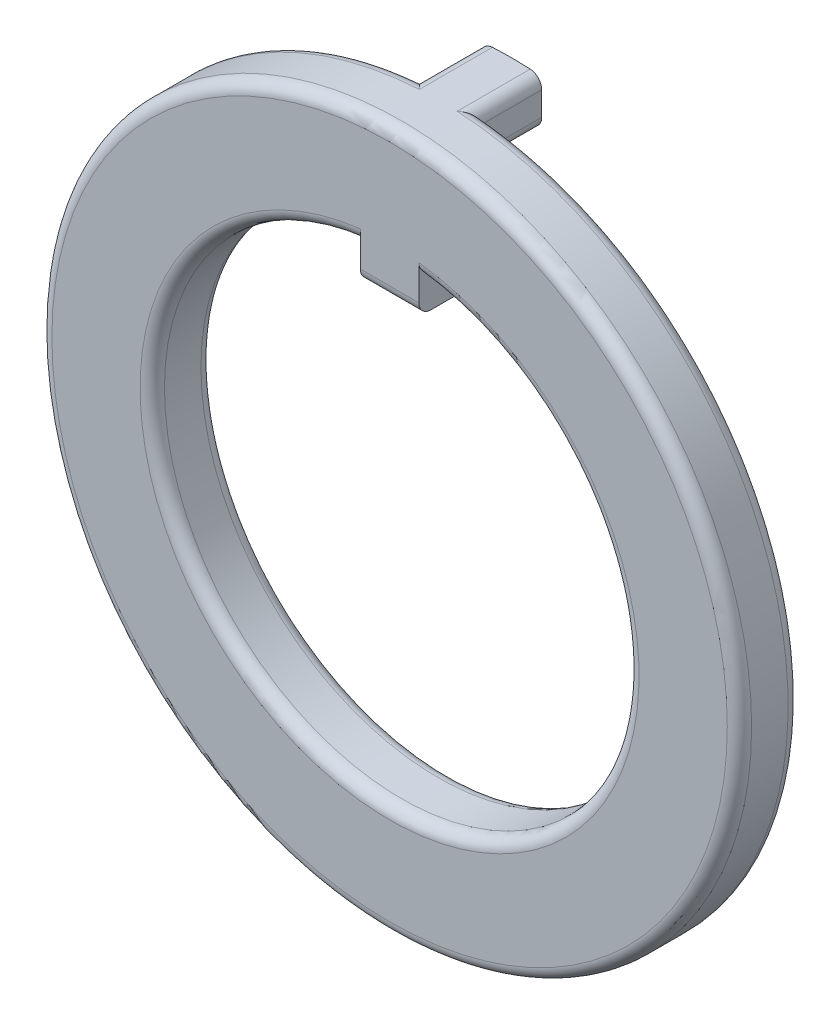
ISO-10303-21;
HEADER;
FILE_DESCRIPTION(('STEP AP214'),'2;1');
FILE_NAME('part.step','',(''),(''),'','','');
FILE_SCHEMA(('AUTOMOTIVE_DESIGN { 1 0 10303 214 1 1 1 1 }'));
ENDSEC;
DATA;
#1=APPLICATION_CONTEXT('core data for automotive mechanical design processes');
#2=APPLICATION_PROTOCOL_DEFINITION('international standard','automotive_design',2000,#1);
#3=PRODUCT_CONTEXT('',#1,'mechanical');
#4=PRODUCT('Part','Part','',(#3));
#5=PRODUCT_RELATED_PRODUCT_CATEGORY('part','',(#4));
#6=PRODUCT_DEFINITION_FORMATION('','',#4);
#7=PRODUCT_DEFINITION_CONTEXT('part definition',#1,'design');
#8=PRODUCT_DEFINITION('design','',#6,#7);
#9=PRODUCT_DEFINITION_SHAPE('','',#8);
#10=(LENGTH_UNIT() NAMED_UNIT(*) SI_UNIT(.MILLI.,.METRE.));
#11=(NAMED_UNIT(*) PLANE_ANGLE_UNIT() SI_UNIT($,.RADIAN.));
#12=(NAMED_UNIT(*) SI_UNIT($,.STERADIAN.) SOLID_ANGLE_UNIT());
#13=UNCERTAINTY_MEASURE_WITH_UNIT(LENGTH_MEASURE(1.E-05),#10,'distance_accuracy_value','');
#14=(GEOMETRIC_REPRESENTATION_CONTEXT(3) GLOBAL_UNCERTAINTY_ASSIGNED_CONTEXT((#13)) GLOBAL_UNIT_ASSIGNED_CONTEXT((#10,
#11,#12)) REPRESENTATION_CONTEXT('',''));
#15=CARTESIAN_POINT('',(0.,0.,0.));
#16=DIRECTION('',(0.,0.,1.));
#17=DIRECTION('',(1.,0.,0.));
#18=AXIS2_PLACEMENT_3D('',#15,#16,#17);
#19=CARTESIAN_POINT('',(0.,0.,2.));
#20=DIRECTION('',(0.,0.,1.));
#21=DIRECTION('',(1.,0.,0.));
#22=AXIS2_PLACEMENT_3D('',#19,#20,#21);
#23=PLANE('',#22);
#24=CARTESIAN_POINT('',(0.,0.,2.));
#25=DIRECTION('',(0.,0.,1.));
#26=DIRECTION('',(1.,0.,0.));
#27=AXIS2_PLACEMENT_3D('',#24,#25,#26);
#28=CIRCLE('',#27,5.55);
#29=CARTESIAN_POINT('',(5.55,0.,2.));
#30=VERTEX_POINT('',#29);
#31=EDGE_CURVE('E332',#30,#30,#28,.T.);
#32=ORIENTED_EDGE('',*,*,#31,.T.);
#33=EDGE_LOOP('',(#32));
#34=FACE_BOUND('',#33,.T.);
#35=DIRECTION('',(0.,1.,0.));
#36=VECTOR('',#35,1.);
#37=CARTESIAN_POINT('',(-0.479999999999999,3.87034882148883,2.));
#38=LINE('',#37,#36);
#39=CARTESIAN_POINT('',(-0.479999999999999,3.5,2.));
#40=VERTEX_POINT('',#39);
#41=CARTESIAN_POINT('',(-0.479999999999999,4.07180549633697,2.));
#42=VERTEX_POINT('',#41);
#43=EDGE_CURVE('E266',#40,#42,#38,.T.);
#44=ORIENTED_EDGE('',*,*,#43,.F.);
#45=DIRECTION('',(-1.,0.,0.));
#46=VECTOR('',#45,1.);
#47=CARTESIAN_POINT('',(0.,3.5,2.));
#48=LINE('',#47,#46);
#49=CARTESIAN_POINT('',(0.48,3.5,2.));
#50=VERTEX_POINT('',#49);
#51=EDGE_CURVE('E41',#40,#50,#48,.F.);
#52=ORIENTED_EDGE('',*,*,#51,.T.);
#53=DIRECTION('',(0.,-1.,0.));
#54=VECTOR('',#53,1.);
#55=CARTESIAN_POINT('',(0.48,3.3,2.));
#56=LINE('',#55,#54);
#57=CARTESIAN_POINT('',(0.48,4.07180549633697,2.));
#58=VERTEX_POINT('',#57);
#59=EDGE_CURVE('E384',#58,#50,#56,.T.);
#60=ORIENTED_EDGE('',*,*,#59,.F.);
#61=CARTESIAN_POINT('',(0.,0.,2.));
#62=DIRECTION('',(0.,0.,1.));
#63=DIRECTION('',(1.,0.,0.));
#64=AXIS2_PLACEMENT_3D('',#61,#62,#63);
#65=CIRCLE('',#64,4.1);
#66=EDGE_CURVE('E329',#58,#42,#65,.F.);
#67=ORIENTED_EDGE('',*,*,#66,.T.);
#68=EDGE_LOOP('',(#44,#52,#60,#67));
#69=FACE_BOUND('',#68,.T.);
#70=ADVANCED_FACE('F33',(#34,#69),#23,.T.);
#71=CARTESIAN_POINT('',(0.,0.,0.));
#72=DIRECTION('',(0.,0.,1.));
#73=DIRECTION('',(1.,0.,0.));
#74=AXIS2_PLACEMENT_3D('',#71,#72,#73);
#75=PLANE('',#74);
#76=CARTESIAN_POINT('',(0.,0.,0.));
#77=DIRECTION('',(0.,0.,1.));
#78=DIRECTION('',(1.,0.,0.));
#79=AXIS2_PLACEMENT_3D('',#76,#77,#78);
#80=CIRCLE('',#79,5.75);
#81=CARTESIAN_POINT('',(0.310810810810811,5.74159356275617,0.));
#82=VERTEX_POINT('',#81);
#83=CARTESIAN_POINT('',(-0.310810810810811,5.74159356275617,0.));
#84=VERTEX_POINT('',#83);
#85=EDGE_CURVE('E272',#82,#84,#80,.T.);
#86=ORIENTED_EDGE('',*,*,#85,.F.);
#87=CARTESIAN_POINT('',(0.3,5.54188596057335,0.));
#88=DIRECTION('',(0.,0.,1.));
#89=DIRECTION('',(1.,0.,0.));
#90=AXIS2_PLACEMENT_3D('',#87,#88,#89);
#91=CIRCLE('',#90,0.2);
#92=CARTESIAN_POINT('',(0.5,5.54188596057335,0.));
#93=VERTEX_POINT('',#92);
#94=EDGE_CURVE('E361',#82,#93,#91,.F.);
#95=ORIENTED_EDGE('',*,*,#94,.T.);
#96=DIRECTION('',(0.,1.,0.));
#97=VECTOR('',#96,1.);
#98=CARTESIAN_POINT('',(0.5,8.,0.));
#99=LINE('',#98,#97);
#100=CARTESIAN_POINT('',(0.5,5.15,0.));
#101=VERTEX_POINT('',#100);
#102=EDGE_CURVE('E173',#101,#93,#99,.T.);
#103=ORIENTED_EDGE('',*,*,#102,.F.);
#104=CARTESIAN_POINT('',(0.3,5.15,0.));
#105=DIRECTION('',(0.,0.,1.));
#106=DIRECTION('',(1.,0.,0.));
#107=AXIS2_PLACEMENT_3D('',#104,#105,#106);
#108=CIRCLE('',#107,0.2);
#109=CARTESIAN_POINT('',(0.3,4.95,0.));
#110=VERTEX_POINT('',#109);
#111=EDGE_CURVE('E363',#101,#110,#108,.F.);
#112=ORIENTED_EDGE('',*,*,#111,.T.);
#113=DIRECTION('',(-1.,0.,0.));
#114=VECTOR('',#113,1.);
#115=CARTESIAN_POINT('',(0.,4.95,0.));
#116=LINE('',#115,#114);
#117=CARTESIAN_POINT('',(-0.3,4.95,0.));
#118=VERTEX_POINT('',#117);
#119=EDGE_CURVE('E380',#110,#118,#116,.T.);
#120=ORIENTED_EDGE('',*,*,#119,.T.);
#121=CARTESIAN_POINT('',(-0.3,5.15,0.));
#122=DIRECTION('',(0.,0.,1.));
#123=DIRECTION('',(1.,0.,0.));
#124=AXIS2_PLACEMENT_3D('',#121,#122,#123);
#125=CIRCLE('',#124,0.2);
#126=CARTESIAN_POINT('',(-0.5,5.15,0.));
#127=VERTEX_POINT('',#126);
#128=EDGE_CURVE('E365',#118,#127,#125,.F.);
#129=ORIENTED_EDGE('',*,*,#128,.T.);
#130=DIRECTION('',(0.,-1.,0.));
#131=VECTOR('',#130,1.);
#132=CARTESIAN_POINT('',(-0.5,8.,0.));
#133=LINE('',#132,#131);
#134=CARTESIAN_POINT('',(-0.5,5.54188596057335,0.));
#135=VERTEX_POINT('',#134);
#136=EDGE_CURVE('E172',#135,#127,#133,.T.);
#137=ORIENTED_EDGE('',*,*,#136,.F.);
#138=CARTESIAN_POINT('',(-0.3,5.54188596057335,0.));
#139=DIRECTION('',(0.,0.,1.));
#140=DIRECTION('',(1.,0.,0.));
#141=AXIS2_PLACEMENT_3D('',#138,#139,#140);
#142=CIRCLE('',#141,0.2);
#143=EDGE_CURVE('E350',#135,#84,#142,.F.);
#144=ORIENTED_EDGE('',*,*,#143,.T.);
#145=EDGE_LOOP('',(#86,#95,#103,#112,#120,#129,#137,#144));
#146=FACE_BOUND('',#145,.T.);
#147=ADVANCED_FACE('F396',(#146),#75,.F.);
#148=CARTESIAN_POINT('',(0.,0.,2.));
#149=DIRECTION('',(0.,0.,-1.));
#150=DIRECTION('',(-1.,0.,0.));
#151=AXIS2_PLACEMENT_3D('',#148,#149,#150);
#152=CYLINDRICAL_SURFACE('',#151,5.75);
#153=CARTESIAN_POINT('',(0.,0.,1.8));
#154=DIRECTION('',(0.,0.,1.));
#155=DIRECTION('',(1.,0.,0.));
#156=AXIS2_PLACEMENT_3D('',#153,#154,#155);
#157=CIRCLE('',#156,5.75);
#158=CARTESIAN_POINT('',(5.75,0.,1.8));
#159=VERTEX_POINT('',#158);
#160=EDGE_CURVE('E326',#159,#159,#157,.F.);
#161=ORIENTED_EDGE('',*,*,#160,.T.);
#162=EDGE_LOOP('',(#161));
#163=FACE_BOUND('',#162,.T.);
#164=CARTESIAN_POINT('',(0.,0.,1.2));
#165=DIRECTION('',(0.,0.,1.));
#166=DIRECTION('',(0.,-1.,0.));
#167=AXIS2_PLACEMENT_3D('',#164,#165,#166);
#168=CIRCLE('',#167,5.75);
#169=CARTESIAN_POINT('',(-0.310810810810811,5.74159356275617,1.2));
#170=VERTEX_POINT('',#169);
#171=CARTESIAN_POINT('',(0.310810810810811,5.74159356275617,1.2));
#172=VERTEX_POINT('',#171);
#173=EDGE_CURVE('E178',#170,#172,#168,.T.);
#174=ORIENTED_EDGE('',*,*,#173,.T.);
#175=DIRECTION('',(0.,0.,-1.));
#176=VECTOR('',#175,1.);
#177=CARTESIAN_POINT('',(0.310810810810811,5.74159356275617,2.));
#178=LINE('',#177,#176);
#179=EDGE_CURVE('E368',#172,#82,#178,.T.);
#180=ORIENTED_EDGE('',*,*,#179,.T.);
#181=ORIENTED_EDGE('',*,*,#85,.T.);
#182=DIRECTION('',(0.,0.,-1.));
#183=VECTOR('',#182,1.);
#184=CARTESIAN_POINT('',(-0.310810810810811,5.74159356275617,2.));
#185=LINE('',#184,#183);
#186=EDGE_CURVE('E371',#84,#170,#185,.F.);
#187=ORIENTED_EDGE('',*,*,#186,.T.);
#188=EDGE_LOOP('',(#174,#180,#181,#187));
#189=FACE_BOUND('',#188,.T.);
#190=ADVANCED_FACE('F200',(#163,#189),#152,.T.);
#191=CARTESIAN_POINT('',(0.,0.,2.));
#192=DIRECTION('',(0.,0.,-1.));
#193=DIRECTION('',(-1.,0.,0.));
#194=AXIS2_PLACEMENT_3D('',#191,#192,#193);
#195=CYLINDRICAL_SURFACE('',#194,3.9);
#196=DIRECTION('',(0.,0.,-1.));
#197=VECTOR('',#196,1.);
#198=CARTESIAN_POINT('',(0.48,3.87034882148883,2.));
#199=LINE('',#198,#197);
#200=CARTESIAN_POINT('',(0.48,3.87034882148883,1.8));
#201=VERTEX_POINT('',#200);
#202=CARTESIAN_POINT('',(0.48,3.87034882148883,1.2));
#203=VERTEX_POINT('',#202);
#204=EDGE_CURVE('E263',#201,#203,#199,.T.);
#205=ORIENTED_EDGE('',*,*,#204,.T.);
#206=CARTESIAN_POINT('',(0.,0.,1.2));
#207=DIRECTION('',(0.,0.,1.));
#208=DIRECTION('',(0.,-1.,0.));
#209=AXIS2_PLACEMENT_3D('',#206,#207,#208);
#210=CIRCLE('',#209,3.9);
#211=CARTESIAN_POINT('',(-0.479999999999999,3.87034882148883,1.2));
#212=VERTEX_POINT('',#211);
#213=EDGE_CURVE('E291',#203,#212,#210,.F.);
#214=ORIENTED_EDGE('',*,*,#213,.T.);
#215=DIRECTION('',(0.,0.,-1.));
#216=VECTOR('',#215,1.);
#217=CARTESIAN_POINT('',(-0.479999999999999,3.87034882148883,2.));
#218=LINE('',#217,#216);
#219=CARTESIAN_POINT('',(-0.479999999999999,3.87034882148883,1.8));
#220=VERTEX_POINT('',#219);
#221=EDGE_CURVE('E261',#220,#212,#218,.T.);
#222=ORIENTED_EDGE('',*,*,#221,.F.);
#223=CARTESIAN_POINT('',(0.,0.,1.8));
#224=DIRECTION('',(0.,0.,1.));
#225=DIRECTION('',(1.,0.,0.));
#226=AXIS2_PLACEMENT_3D('',#223,#224,#225);
#227=CIRCLE('',#226,3.9);
#228=EDGE_CURVE('E334',#220,#201,#227,.T.);
#229=ORIENTED_EDGE('',*,*,#228,.T.);
#230=EDGE_LOOP('',(#205,#214,#222,#229));
#231=FACE_BOUND('',#230,.T.);
#232=ADVANCED_FACE('F317',(#231),#195,.F.);
#233=CARTESIAN_POINT('',(0.48,3.3,2.));
#234=DIRECTION('',(1.,0.,0.));
#235=DIRECTION('',(0.,0.,-1.));
#236=AXIS2_PLACEMENT_3D('',#233,#234,#235);
#237=PLANE('',#236);
#238=ORIENTED_EDGE('',*,*,#59,.T.);
#239=CARTESIAN_POINT('',(0.48,3.5,1.8));
#240=DIRECTION('',(1.,0.,0.));
#241=DIRECTION('',(0.,0.,-1.));
#242=AXIS2_PLACEMENT_3D('',#239,#240,#241);
#243=CIRCLE('',#242,0.2);
#244=CARTESIAN_POINT('',(0.48,3.3,1.8));
#245=VERTEX_POINT('',#244);
#246=EDGE_CURVE('E11',#50,#245,#243,.T.);
#247=ORIENTED_EDGE('',*,*,#246,.T.);
#248=DIRECTION('',(0.,0.,-1.));
#249=VECTOR('',#248,1.);
#250=CARTESIAN_POINT('',(0.48,3.3,2.));
#251=LINE('',#250,#249);
#252=CARTESIAN_POINT('',(0.48,3.3,1.2));
#253=VERTEX_POINT('',#252);
#254=EDGE_CURVE('E254',#245,#253,#251,.T.);
#255=ORIENTED_EDGE('',*,*,#254,.T.);
#256=CARTESIAN_POINT('',(0.480000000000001,3.5,1.2));
#257=DIRECTION('',(1.,0.,0.));
#258=DIRECTION('',(0.,0.,-1.));
#259=AXIS2_PLACEMENT_3D('',#256,#257,#258);
#260=CIRCLE('',#259,0.2);
#261=CARTESIAN_POINT('',(0.48,3.5,1.));
#262=VERTEX_POINT('',#261);
#263=EDGE_CURVE('E373',#253,#262,#260,.T.);
#264=ORIENTED_EDGE('',*,*,#263,.T.);
#265=DIRECTION('',(0.,-1.,0.));
#266=VECTOR('',#265,1.);
#267=CARTESIAN_POINT('',(0.48,3.3,1.));
#268=LINE('',#267,#266);
#269=CARTESIAN_POINT('',(0.48,4.07180549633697,1.));
#270=VERTEX_POINT('',#269);
#271=EDGE_CURVE('E379',#270,#262,#268,.T.);
#272=ORIENTED_EDGE('',*,*,#271,.F.);
#273=CARTESIAN_POINT('',(0.48,4.07180549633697,1.));
#274=CARTESIAN_POINT('',(0.48,4.06041357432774,0.999990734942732));
#275=CARTESIAN_POINT('',(0.48,4.04902416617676,1.00095943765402));
#276=CARTESIAN_POINT('',(0.48,4.02657338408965,1.00478417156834));
#277=CARTESIAN_POINT('',(0.48,4.01551181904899,1.00763907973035));
#278=CARTESIAN_POINT('',(0.48,3.99401968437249,1.01516977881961));
#279=CARTESIAN_POINT('',(0.48,3.98358945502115,1.01984654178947));
#280=CARTESIAN_POINT('',(0.48,3.96366727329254,1.03088806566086));
#281=CARTESIAN_POINT('',(0.48,3.95417510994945,1.03725244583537));
#282=CARTESIAN_POINT('',(0.48,3.93642754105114,1.051472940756));
#283=CARTESIAN_POINT('',(0.48,3.92816866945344,1.05932472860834));
#284=CARTESIAN_POINT('',(0.48,3.91309557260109,1.07631380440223));
#285=CARTESIAN_POINT('',(0.48,3.9062816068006,1.08545132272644));
#286=CARTESIAN_POINT('',(0.48,3.89434291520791,1.10468552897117));
#287=CARTESIAN_POINT('',(0.48,3.88920734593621,1.1147754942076));
#288=CARTESIAN_POINT('',(0.48,3.88071939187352,1.13567614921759));
#289=CARTESIAN_POINT('',(0.48,3.87736577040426,1.14648633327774));
#290=CARTESIAN_POINT('',(0.48,3.87342253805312,1.16447542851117));
#291=CARTESIAN_POINT('',(0.48,3.87227059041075,1.17153603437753));
#292=CARTESIAN_POINT('',(0.48,3.8707338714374,1.18573004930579));
#293=CARTESIAN_POINT('',(0.48,3.87034801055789,1.19286334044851));
#294=CARTESIAN_POINT('',(0.48,3.8703488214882,1.19999999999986));
#295=B_SPLINE_CURVE_WITH_KNOTS('',3,(#273,#274,#275,#276,#277,#278,#279,#280,#281,#282,#283,
#284,#285,#286,#287,#288,#289,#290,#291,#292,#293,#294),.UNSPECIFIED.,.F.,.F.,(4,2,2,2,2,2,2,2,
2,2,4),(0.,0.034131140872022,0.0682419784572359,0.102371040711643,0.136492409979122,
0.170516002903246,0.204545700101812,0.238350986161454,0.272132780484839,0.293556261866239,
0.314949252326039),.UNSPECIFIED.);
#296=EDGE_CURVE('E287',#270,#203,#295,.T.);
#297=ORIENTED_EDGE('',*,*,#296,.T.);
#298=ORIENTED_EDGE('',*,*,#204,.F.);
#299=CARTESIAN_POINT('',(0.48,3.87034882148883,1.8));
#300=CARTESIAN_POINT('',(0.48,3.87033889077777,1.81119067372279));
#301=CARTESIAN_POINT('',(0.48,3.8712946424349,1.82237795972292));
#302=CARTESIAN_POINT('',(0.48,3.8750635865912,1.84442405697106));
#303=CARTESIAN_POINT('',(0.48,3.87787490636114,1.85528318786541));
#304=CARTESIAN_POINT('',(0.48,3.88528282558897,1.87637932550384));
#305=CARTESIAN_POINT('',(0.48,3.88988014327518,1.88661608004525));
#306=CARTESIAN_POINT('',(0.48,3.90072110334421,1.90617498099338));
#307=CARTESIAN_POINT('',(0.48,3.906964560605,1.91549723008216));
#308=CARTESIAN_POINT('',(0.48,3.92094197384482,1.93300041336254));
#309=CARTESIAN_POINT('',(0.48,3.92868098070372,1.94117731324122));
#310=CARTESIAN_POINT('',(0.48,3.94541489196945,1.95612855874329));
#311=CARTESIAN_POINT('',(0.48,3.95441006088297,1.96290260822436));
#312=CARTESIAN_POINT('',(0.48,3.97346895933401,1.97490609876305));
#313=CARTESIAN_POINT('',(0.48,3.98354001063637,1.9801239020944));
#314=CARTESIAN_POINT('',(0.48,4.00440967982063,1.98880433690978));
#315=CARTESIAN_POINT('',(0.48,4.01520793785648,1.99226782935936));
#316=CARTESIAN_POINT('',(0.48,4.03368757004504,1.99653316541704));
#317=CARTESIAN_POINT('',(0.48,4.04125799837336,1.99783237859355));
#318=CARTESIAN_POINT('',(0.48,4.05648644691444,1.99956572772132));
#319=CARTESIAN_POINT('',(0.48,4.06414432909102,2.00000107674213));
#320=CARTESIAN_POINT('',(0.48,4.07180549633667,2.00000000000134));
#321=B_SPLINE_CURVE_WITH_KNOTS('',3,(#299,#300,#301,#302,#303,#304,#305,#306,#307,#308,#309,
#310,#311,#312,#313,#314,#315,#316,#317,#318,#319,#320),.UNSPECIFIED.,.F.,.F.,(4,2,2,2,2,2,2,2,
2,2,4),(0.,0.0335263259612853,0.0670188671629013,0.100524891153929,0.134027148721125,
0.167644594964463,0.201269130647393,0.235139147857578,0.268992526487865,0.291989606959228,
0.314954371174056),.UNSPECIFIED.);
#322=EDGE_CURVE('E295',#201,#58,#321,.T.);
#323=ORIENTED_EDGE('',*,*,#322,.T.);
#324=EDGE_LOOP('',(#238,#247,#255,#264,#272,#297,#298,#323));
#325=FACE_BOUND('',#324,.T.);
#326=ADVANCED_FACE('F312',(#325),#237,.T.);
#327=CARTESIAN_POINT('',(-0.479999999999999,3.3,2.));
#328=DIRECTION('',(0.,-1.,0.));
#329=DIRECTION('',(0.,0.,-1.));
#330=AXIS2_PLACEMENT_3D('',#327,#328,#329);
#331=PLANE('',#330);
#332=ORIENTED_EDGE('',*,*,#254,.F.);
#333=DIRECTION('',(-1.,0.,0.));
#334=VECTOR('',#333,1.);
#335=CARTESIAN_POINT('',(-0.479999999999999,3.3,1.8));
#336=LINE('',#335,#334);
#337=CARTESIAN_POINT('',(-0.479999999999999,3.3,1.8));
#338=VERTEX_POINT('',#337);
#339=EDGE_CURVE('E243',#245,#338,#336,.T.);
#340=ORIENTED_EDGE('',*,*,#339,.T.);
#341=DIRECTION('',(0.,0.,-1.));
#342=VECTOR('',#341,1.);
#343=CARTESIAN_POINT('',(-0.479999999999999,3.3,2.));
#344=LINE('',#343,#342);
#345=CARTESIAN_POINT('',(-0.479999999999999,3.3,1.2));
#346=VERTEX_POINT('',#345);
#347=EDGE_CURVE('E252',#338,#346,#344,.T.);
#348=ORIENTED_EDGE('',*,*,#347,.T.);
#349=DIRECTION('',(-1.,0.,0.));
#350=VECTOR('',#349,1.);
#351=CARTESIAN_POINT('',(0.48,3.3,1.2));
#352=LINE('',#351,#350);
#353=EDGE_CURVE('E375',#346,#253,#352,.F.);
#354=ORIENTED_EDGE('',*,*,#353,.T.);
#355=EDGE_LOOP('',(#332,#340,#348,#354));
#356=FACE_BOUND('',#355,.T.);
#357=ADVANCED_FACE('F250',(#356),#331,.T.);
#358=CARTESIAN_POINT('',(-0.479999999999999,3.87034882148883,2.));
#359=DIRECTION('',(-1.,0.,0.));
#360=DIRECTION('',(0.,-1.,0.));
#361=AXIS2_PLACEMENT_3D('',#358,#359,#360);
#362=PLANE('',#361);
#363=ORIENTED_EDGE('',*,*,#347,.F.);
#364=CARTESIAN_POINT('',(-0.479999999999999,3.5,1.8));
#365=DIRECTION('',(-1.,0.,0.));
#366=DIRECTION('',(0.,-1.,0.));
#367=AXIS2_PLACEMENT_3D('',#364,#365,#366);
#368=CIRCLE('',#367,0.2);
#369=EDGE_CURVE('E55',#338,#40,#368,.T.);
#370=ORIENTED_EDGE('',*,*,#369,.T.);
#371=ORIENTED_EDGE('',*,*,#43,.T.);
#372=CARTESIAN_POINT('',(-0.479999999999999,4.07180549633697,2.));
#373=CARTESIAN_POINT('',(-0.479999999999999,4.06041357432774,2.00000926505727));
#374=CARTESIAN_POINT('',(-0.479999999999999,4.04902416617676,1.99904056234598));
#375=CARTESIAN_POINT('',(-0.479999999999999,4.02657338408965,1.99521582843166));
#376=CARTESIAN_POINT('',(-0.479999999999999,4.01551181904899,1.99236092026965));
#377=CARTESIAN_POINT('',(-0.479999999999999,3.99401968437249,1.98483022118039));
#378=CARTESIAN_POINT('',(-0.479999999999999,3.98358945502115,1.98015345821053));
#379=CARTESIAN_POINT('',(-0.479999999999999,3.96366727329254,1.96911193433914));
#380=CARTESIAN_POINT('',(-0.479999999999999,3.95417510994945,1.96274755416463));
#381=CARTESIAN_POINT('',(-0.479999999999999,3.93642754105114,1.948527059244));
#382=CARTESIAN_POINT('',(-0.479999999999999,3.92816866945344,1.94067527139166));
#383=CARTESIAN_POINT('',(-0.479999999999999,3.91309557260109,1.92368619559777));
#384=CARTESIAN_POINT('',(-0.479999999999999,3.9062816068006,1.91454867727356));
#385=CARTESIAN_POINT('',(-0.479999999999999,3.89434291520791,1.89531447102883));
#386=CARTESIAN_POINT('',(-0.479999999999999,3.88920734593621,1.8852245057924));
#387=CARTESIAN_POINT('',(-0.479999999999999,3.88071939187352,1.86432385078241));
#388=CARTESIAN_POINT('',(-0.479999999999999,3.87736577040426,1.85351366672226));
#389=CARTESIAN_POINT('',(-0.479999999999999,3.87342253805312,1.83552457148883));
#390=CARTESIAN_POINT('',(-0.479999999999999,3.87227059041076,1.82846396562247));
#391=CARTESIAN_POINT('',(-0.479999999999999,3.8707338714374,1.81426995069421));
#392=CARTESIAN_POINT('',(-0.479999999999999,3.87034801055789,1.80713665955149));
#393=CARTESIAN_POINT('',(-0.479999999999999,3.8703488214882,1.80000000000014));
#394=B_SPLINE_CURVE_WITH_KNOTS('',3,(#372,#373,#374,#375,#376,#377,#378,#379,#380,#381,#382,
#383,#384,#385,#386,#387,#388,#389,#390,#391,#392,#393),.UNSPECIFIED.,.F.,.F.,(4,2,2,2,2,2,2,2,
2,2,4),(0.,0.034131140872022,0.0682419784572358,0.102371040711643,0.136492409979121,
0.170516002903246,0.204545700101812,0.238350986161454,0.272132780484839,0.293556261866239,
0.314949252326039),.UNSPECIFIED.);
#395=EDGE_CURVE('E292',#42,#220,#394,.T.);
#396=ORIENTED_EDGE('',*,*,#395,.T.);
#397=ORIENTED_EDGE('',*,*,#221,.T.);
#398=CARTESIAN_POINT('',(-0.479999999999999,3.87034882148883,1.2));
#399=CARTESIAN_POINT('',(-0.479999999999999,3.87033889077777,1.18880932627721));
#400=CARTESIAN_POINT('',(-0.479999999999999,3.8712946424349,1.17762204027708));
#401=CARTESIAN_POINT('',(-0.479999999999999,3.8750635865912,1.15557594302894));
#402=CARTESIAN_POINT('',(-0.479999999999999,3.87787490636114,1.14471681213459));
#403=CARTESIAN_POINT('',(-0.479999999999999,3.88528282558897,1.12362067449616));
#404=CARTESIAN_POINT('',(-0.479999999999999,3.88988014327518,1.11338391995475));
#405=CARTESIAN_POINT('',(-0.479999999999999,3.90072110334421,1.09382501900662));
#406=CARTESIAN_POINT('',(-0.479999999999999,3.906964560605,1.08450276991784));
#407=CARTESIAN_POINT('',(-0.479999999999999,3.92094197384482,1.06699958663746));
#408=CARTESIAN_POINT('',(-0.479999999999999,3.92868098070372,1.05882268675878));
#409=CARTESIAN_POINT('',(-0.479999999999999,3.94541489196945,1.04387144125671));
#410=CARTESIAN_POINT('',(-0.479999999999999,3.95441006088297,1.03709739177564));
#411=CARTESIAN_POINT('',(-0.479999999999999,3.97346895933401,1.02509390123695));
#412=CARTESIAN_POINT('',(-0.479999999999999,3.98354001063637,1.0198760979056));
#413=CARTESIAN_POINT('',(-0.479999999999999,4.00440967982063,1.01119566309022));
#414=CARTESIAN_POINT('',(-0.479999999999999,4.01520793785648,1.00773217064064));
#415=CARTESIAN_POINT('',(-0.479999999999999,4.03368757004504,1.00346683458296));
#416=CARTESIAN_POINT('',(-0.479999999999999,4.04125799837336,1.00216762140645));
#417=CARTESIAN_POINT('',(-0.479999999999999,4.05648644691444,1.00043427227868));
#418=CARTESIAN_POINT('',(-0.479999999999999,4.06414432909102,0.999998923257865));
#419=CARTESIAN_POINT('',(-0.479999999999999,4.07180549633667,0.99999999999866));
#420=B_SPLINE_CURVE_WITH_KNOTS('',3,(#398,#399,#400,#401,#402,#403,#404,#405,#406,#407,#408,
#409,#410,#411,#412,#413,#414,#415,#416,#417,#418,#419),.UNSPECIFIED.,.F.,.F.,(4,2,2,2,2,2,2,2,
2,2,4),(0.,0.0335263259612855,0.0670188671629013,0.100524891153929,0.134027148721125,
0.167644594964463,0.201269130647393,0.235139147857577,0.268992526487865,0.291989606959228,
0.314954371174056),.UNSPECIFIED.);
#421=CARTESIAN_POINT('',(-0.479999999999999,4.07180549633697,1.));
#422=VERTEX_POINT('',#421);
#423=EDGE_CURVE('E283',#212,#422,#420,.T.);
#424=ORIENTED_EDGE('',*,*,#423,.T.);
#425=DIRECTION('',(0.,1.,0.));
#426=VECTOR('',#425,1.);
#427=CARTESIAN_POINT('',(-0.479999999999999,3.87034882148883,1.));
#428=LINE('',#427,#426);
#429=CARTESIAN_POINT('',(-0.479999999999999,3.5,1.));
#430=VERTEX_POINT('',#429);
#431=EDGE_CURVE('E180',#430,#422,#428,.T.);
#432=ORIENTED_EDGE('',*,*,#431,.F.);
#433=CARTESIAN_POINT('',(-0.48,3.5,1.2));
#434=DIRECTION('',(-1.,0.,0.));
#435=DIRECTION('',(0.,-1.,0.));
#436=AXIS2_PLACEMENT_3D('',#433,#434,#435);
#437=CIRCLE('',#436,0.2);
#438=EDGE_CURVE('E259',#430,#346,#437,.T.);
#439=ORIENTED_EDGE('',*,*,#438,.T.);
#440=EDGE_LOOP('',(#363,#370,#371,#396,#397,#424,#432,#439));
#441=FACE_BOUND('',#440,.T.);
#442=ADVANCED_FACE('F257',(#441),#362,.T.);
#443=CARTESIAN_POINT('',(-10.,4.95,1.));
#444=DIRECTION('',(0.,1.,0.));
#445=DIRECTION('',(0.,0.,1.));
#446=AXIS2_PLACEMENT_3D('',#443,#444,#445);
#447=PLANE('',#446);
#448=ORIENTED_EDGE('',*,*,#119,.F.);
#449=DIRECTION('',(0.,0.,1.));
#450=VECTOR('',#449,1.);
#451=CARTESIAN_POINT('',(0.3,4.95,1.));
#452=LINE('',#451,#450);
#453=CARTESIAN_POINT('',(0.3,4.95,1.));
#454=VERTEX_POINT('',#453);
#455=EDGE_CURVE('E351',#110,#454,#452,.T.);
#456=ORIENTED_EDGE('',*,*,#455,.T.);
#457=DIRECTION('',(1.,0.,0.));
#458=VECTOR('',#457,1.);
#459=CARTESIAN_POINT('',(-10.,4.95,1.));
#460=LINE('',#459,#458);
#461=CARTESIAN_POINT('',(-0.3,4.95,1.));
#462=VERTEX_POINT('',#461);
#463=EDGE_CURVE('E381',#462,#454,#460,.T.);
#464=ORIENTED_EDGE('',*,*,#463,.F.);
#465=DIRECTION('',(0.,0.,-1.));
#466=VECTOR('',#465,1.);
#467=CARTESIAN_POINT('',(-0.3,4.95,1.));
#468=LINE('',#467,#466);
#469=EDGE_CURVE('E353',#462,#118,#468,.T.);
#470=ORIENTED_EDGE('',*,*,#469,.T.);
#471=EDGE_LOOP('',(#448,#456,#464,#470));
#472=FACE_BOUND('',#471,.T.);
#473=ADVANCED_FACE('F427',(#472),#447,.F.);
#474=CARTESIAN_POINT('',(-10.,4.95,1.));
#475=DIRECTION('',(0.,0.,1.));
#476=DIRECTION('',(0.,-1.,0.));
#477=AXIS2_PLACEMENT_3D('',#474,#475,#476);
#478=PLANE('',#477);
#479=ORIENTED_EDGE('',*,*,#463,.T.);
#480=CARTESIAN_POINT('',(0.3,5.15,1.));
#481=DIRECTION('',(0.,0.,1.));
#482=DIRECTION('',(0.,-1.,0.));
#483=AXIS2_PLACEMENT_3D('',#480,#481,#482);
#484=CIRCLE('',#483,0.2);
#485=CARTESIAN_POINT('',(0.5,5.15,1.));
#486=VERTEX_POINT('',#485);
#487=EDGE_CURVE('E171',#454,#486,#484,.T.);
#488=ORIENTED_EDGE('',*,*,#487,.T.);
#489=DIRECTION('',(0.,1.,0.));
#490=VECTOR('',#489,1.);
#491=CARTESIAN_POINT('',(0.5,8.,1.));
#492=LINE('',#491,#490);
#493=CARTESIAN_POINT('',(0.5,5.52743159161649,1.));
#494=VERTEX_POINT('',#493);
#495=EDGE_CURVE('E154',#486,#494,#492,.T.);
#496=ORIENTED_EDGE('',*,*,#495,.T.);
#497=CARTESIAN_POINT('',(0.,0.,0.999999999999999));
#498=DIRECTION('',(0.,0.,1.));
#499=DIRECTION('',(0.,-1.,0.));
#500=AXIS2_PLACEMENT_3D('',#497,#498,#499);
#501=CIRCLE('',#500,5.55);
#502=CARTESIAN_POINT('',(-0.5,5.52743159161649,1.));
#503=VERTEX_POINT('',#502);
#504=EDGE_CURVE('E163',#494,#503,#501,.F.);
#505=ORIENTED_EDGE('',*,*,#504,.T.);
#506=DIRECTION('',(0.,-1.,0.));
#507=VECTOR('',#506,1.);
#508=CARTESIAN_POINT('',(-0.5,8.,1.));
#509=LINE('',#508,#507);
#510=CARTESIAN_POINT('',(-0.5,5.15,1.));
#511=VERTEX_POINT('',#510);
#512=EDGE_CURVE('E345',#503,#511,#509,.T.);
#513=ORIENTED_EDGE('',*,*,#512,.T.);
#514=CARTESIAN_POINT('',(-0.3,5.15,1.));
#515=DIRECTION('',(0.,0.,1.));
#516=DIRECTION('',(0.,-1.,0.));
#517=AXIS2_PLACEMENT_3D('',#514,#515,#516);
#518=CIRCLE('',#517,0.2);
#519=EDGE_CURVE('E244',#511,#462,#518,.T.);
#520=ORIENTED_EDGE('',*,*,#519,.T.);
#521=EDGE_LOOP('',(#479,#488,#496,#505,#513,#520));
#522=FACE_BOUND('',#521,.T.);
#523=ORIENTED_EDGE('',*,*,#271,.T.);
#524=DIRECTION('',(-1.,0.,0.));
#525=VECTOR('',#524,1.);
#526=CARTESIAN_POINT('',(-0.48,3.5,1.));
#527=LINE('',#526,#525);
#528=EDGE_CURVE('E281',#262,#430,#527,.T.);
#529=ORIENTED_EDGE('',*,*,#528,.T.);
#530=ORIENTED_EDGE('',*,*,#431,.T.);
#531=CARTESIAN_POINT('',(0.,0.,0.999999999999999));
#532=DIRECTION('',(0.,0.,1.));
#533=DIRECTION('',(0.,-1.,0.));
#534=AXIS2_PLACEMENT_3D('',#531,#532,#533);
#535=CIRCLE('',#534,4.1);
#536=EDGE_CURVE('E279',#422,#270,#535,.T.);
#537=ORIENTED_EDGE('',*,*,#536,.T.);
#538=EDGE_LOOP('',(#523,#529,#530,#537));
#539=FACE_BOUND('',#538,.T.);
#540=ADVANCED_FACE('F167',(#522,#539),#478,.F.);
#541=CARTESIAN_POINT('',(-0.5,8.,1.));
#542=DIRECTION('',(1.,0.,0.));
#543=DIRECTION('',(0.,1.,0.));
#544=AXIS2_PLACEMENT_3D('',#541,#542,#543);
#545=PLANE('',#544);
#546=ORIENTED_EDGE('',*,*,#136,.T.);
#547=DIRECTION('',(0.,0.,-1.));
#548=VECTOR('',#547,1.);
#549=CARTESIAN_POINT('',(-0.5,5.15,1.));
#550=LINE('',#549,#548);
#551=EDGE_CURVE('E216',#127,#511,#550,.F.);
#552=ORIENTED_EDGE('',*,*,#551,.T.);
#553=ORIENTED_EDGE('',*,*,#512,.F.);
#554=CARTESIAN_POINT('',(-0.5,5.52743159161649,1.));
#555=CARTESIAN_POINT('',(-0.5,5.53876060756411,0.999990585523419));
#556=CARTESIAN_POINT('',(-0.5,5.55008707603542,1.00095423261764));
#557=CARTESIAN_POINT('',(-0.5,5.57241285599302,1.00475884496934));
#558=CARTESIAN_POINT('',(-0.5,5.58341237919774,1.00759856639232));
#559=CARTESIAN_POINT('',(-0.5,5.60478366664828,1.01508865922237));
#560=CARTESIAN_POINT('',(-0.5,5.61515509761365,1.01973998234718));
#561=CARTESIAN_POINT('',(-0.5,5.63496584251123,1.03071958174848));
#562=CARTESIAN_POINT('',(-0.5,5.64440535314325,1.03704750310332));
#563=CARTESIAN_POINT('',(-0.5,5.66206594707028,1.05119005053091));
#564=CARTESIAN_POINT('',(-0.5,5.67028935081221,1.05900177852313));
#565=CARTESIAN_POINT('',(-0.5,5.68530367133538,1.07590145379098));
#566=CARTESIAN_POINT('',(-0.5,5.69209431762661,1.08498964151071));
#567=CARTESIAN_POINT('',(-0.5,5.70402212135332,1.10414713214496));
#568=CARTESIAN_POINT('',(-0.5,5.70916505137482,1.11421284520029));
#569=CARTESIAN_POINT('',(-0.5,5.71767864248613,1.13506468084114));
#570=CARTESIAN_POINT('',(-0.5,5.72105043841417,1.14585033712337));
#571=CARTESIAN_POINT('',(-0.5,5.7250607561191,1.16392179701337));
#572=CARTESIAN_POINT('',(-0.5,5.72624462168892,1.17109125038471));
#573=CARTESIAN_POINT('',(-0.5,5.72782392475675,1.18550610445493));
#574=CARTESIAN_POINT('',(-0.5,5.72822048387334,1.19275138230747));
#575=CARTESIAN_POINT('',(-0.5,5.72821961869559,1.19999999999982));
#576=B_SPLINE_CURVE_WITH_KNOTS('',3,(#554,#555,#556,#557,#558,#559,#560,#561,#562,#563,#564,
#565,#566,#567,#568,#569,#570,#571,#572,#573,#574,#575),.UNSPECIFIED.,.F.,.F.,(4,2,2,2,2,2,2,2,
2,2,4),(0.,0.033942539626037,0.0678625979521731,0.101800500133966,0.135731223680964,
0.169596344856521,0.203467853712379,0.237219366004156,0.270949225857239,0.292708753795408,
0.314437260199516),.UNSPECIFIED.);
#577=CARTESIAN_POINT('',(-0.5,5.54188596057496,1.00051876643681));
#578=VERTEX_POINT('',#577);
#579=EDGE_CURVE('E162',#503,#578,#576,.T.);
#580=ORIENTED_EDGE('',*,*,#579,.T.);
#581=DIRECTION('',(0.,0.,-1.));
#582=VECTOR('',#581,1.);
#583=CARTESIAN_POINT('',(-0.5,5.54188596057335,1.));
#584=LINE('',#583,#582);
#585=EDGE_CURVE('E343',#578,#135,#584,.T.);
#586=ORIENTED_EDGE('',*,*,#585,.T.);
#587=EDGE_LOOP('',(#546,#552,#553,#580,#586));
#588=FACE_BOUND('',#587,.T.);
#589=ADVANCED_FACE('F342',(#588),#545,.F.);
#590=CARTESIAN_POINT('',(0.5,8.,1.));
#591=DIRECTION('',(-1.,0.,0.));
#592=DIRECTION('',(0.,-1.,0.));
#593=AXIS2_PLACEMENT_3D('',#590,#591,#592);
#594=PLANE('',#593);
#595=ORIENTED_EDGE('',*,*,#102,.T.);
#596=DIRECTION('',(0.,0.,-1.));
#597=VECTOR('',#596,1.);
#598=CARTESIAN_POINT('',(0.5,5.54188596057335,1.));
#599=LINE('',#598,#597);
#600=CARTESIAN_POINT('',(0.5,5.54188596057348,1.0005187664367));
#601=VERTEX_POINT('',#600);
#602=EDGE_CURVE('E157',#93,#601,#599,.F.);
#603=ORIENTED_EDGE('',*,*,#602,.T.);
#604=CARTESIAN_POINT('',(0.5,5.7282196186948,1.2));
#605=CARTESIAN_POINT('',(0.5,5.72822934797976,1.18877953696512));
#606=CARTESIAN_POINT('',(0.5,5.72727237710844,1.17756217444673));
#607=CARTESIAN_POINT('',(0.5,5.72349712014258,1.1554549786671));
#608=CARTESIAN_POINT('',(0.5,5.72068049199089,1.14456486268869));
#609=CARTESIAN_POINT('',(0.5,5.71325612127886,1.12340769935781));
#610=CARTESIAN_POINT('',(0.5,5.70864758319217,1.11314093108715));
#611=CARTESIAN_POINT('',(0.5,5.69777636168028,1.09352650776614));
#612=CARTESIAN_POINT('',(0.5,5.69151392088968,1.0841787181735));
#613=CARTESIAN_POINT('',(0.5,5.67750201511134,1.06664846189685));
#614=CARTESIAN_POINT('',(0.5,5.66975014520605,1.0584679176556));
#615=CARTESIAN_POINT('',(0.5,5.65298574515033,1.0435171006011));
#616=CARTESIAN_POINT('',(0.5,5.64397296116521,1.03674711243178));
#617=CARTESIAN_POINT('',(0.5,5.62490855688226,1.02478441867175));
#618=CARTESIAN_POINT('',(0.5,5.61485312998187,1.01959778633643));
#619=CARTESIAN_POINT('',(0.5,5.59401818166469,1.01098188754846));
#620=CARTESIAN_POINT('',(0.5,5.58323904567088,1.00755169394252));
#621=CARTESIAN_POINT('',(0.5,5.56490397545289,1.00336917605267));
#622=CARTESIAN_POINT('',(0.5,5.5574603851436,1.0021064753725));
#623=CARTESIAN_POINT('',(0.5,5.54248939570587,1.00042197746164));
#624=CARTESIAN_POINT('',(0.5,5.53496213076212,0.999998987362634));
#625=CARTESIAN_POINT('',(0.5,5.52743159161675,0.999999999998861));
#626=B_SPLINE_CURVE_WITH_KNOTS('',3,(#604,#605,#606,#607,#608,#609,#610,#611,#612,#613,#614,
#615,#616,#617,#618,#619,#620,#621,#622,#623,#624,#625),.UNSPECIFIED.,.F.,.F.,(4,2,2,2,2,2,2,2,
2,2,4),(0.,0.0336161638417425,0.0672023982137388,0.100803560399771,0.134399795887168,
0.168050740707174,0.201708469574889,0.235493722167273,0.269261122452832,0.291866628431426,
0.314439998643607),.UNSPECIFIED.);
#627=EDGE_CURVE('E150',#601,#494,#626,.T.);
#628=ORIENTED_EDGE('',*,*,#627,.T.);
#629=ORIENTED_EDGE('',*,*,#495,.F.);
#630=DIRECTION('',(0.,0.,1.));
#631=VECTOR('',#630,1.);
#632=CARTESIAN_POINT('',(0.5,5.15,1.));
#633=LINE('',#632,#631);
#634=EDGE_CURVE('E359',#486,#101,#633,.F.);
#635=ORIENTED_EDGE('',*,*,#634,.T.);
#636=EDGE_LOOP('',(#595,#603,#628,#629,#635));
#637=FACE_BOUND('',#636,.T.);
#638=ADVANCED_FACE('F153',(#637),#594,.F.);
#639=CARTESIAN_POINT('',(0.,0.,1.2));
#640=DIRECTION('',(0.,0.,1.));
#641=DIRECTION('',(0.,-1.,0.));
#642=AXIS2_PLACEMENT_3D('',#639,#640,#641);
#643=TOROIDAL_SURFACE('',#642,5.55,0.2);
#644=ORIENTED_EDGE('',*,*,#579,.F.);
#645=ORIENTED_EDGE('',*,*,#504,.F.);
#646=ORIENTED_EDGE('',*,*,#627,.F.);
#647=CARTESIAN_POINT('',(0.5,5.54188596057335,1.0005187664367));
#648=CARTESIAN_POINT('',(0.500013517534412,5.5513106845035,1.00118327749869));
#649=CARTESIAN_POINT('',(0.499335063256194,5.56065128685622,1.00252799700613));
#650=CARTESIAN_POINT('',(0.496766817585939,5.57882824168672,1.00637572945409));
#651=CARTESIAN_POINT('',(0.494888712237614,5.58766857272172,1.00886750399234));
#652=CARTESIAN_POINT('',(0.490097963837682,5.60466326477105,1.01481447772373));
#653=CARTESIAN_POINT('',(0.487189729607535,5.61282036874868,1.0182655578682));
#654=CARTESIAN_POINT('',(0.480518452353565,5.62840215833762,1.02594701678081));
#655=CARTESIAN_POINT('',(0.476753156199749,5.63582483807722,1.03017944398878));
#656=CARTESIAN_POINT('',(0.466581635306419,5.6532182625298,1.04140958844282));
#657=CARTESIAN_POINT('',(0.459771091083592,5.66272182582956,1.04876510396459));
#658=CARTESIAN_POINT('',(0.445087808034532,5.68001158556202,1.06437575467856));
#659=CARTESIAN_POINT('',(0.437212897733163,5.68779418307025,1.07263272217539));
#660=CARTESIAN_POINT('',(0.417754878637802,5.70420873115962,1.09281972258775));
#661=CARTESIAN_POINT('',(0.405853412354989,5.71214755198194,1.10500658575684));
#662=CARTESIAN_POINT('',(0.381219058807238,5.72518326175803,1.12998770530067));
#663=CARTESIAN_POINT('',(0.368486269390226,5.73028048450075,1.14278189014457));
#664=CARTESIAN_POINT('',(0.341505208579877,5.73807296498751,1.16970037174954));
#665=CARTESIAN_POINT('',(0.327216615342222,5.74054707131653,1.18384998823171));
#666=CARTESIAN_POINT('',(0.312177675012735,5.74151604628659,1.19865496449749));
#667=CARTESIAN_POINT('',(0.311494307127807,5.74155655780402,1.19932751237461));
#668=CARTESIAN_POINT('',(0.310810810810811,5.74159356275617,1.2));
#669=B_SPLINE_CURVE_WITH_KNOTS('',3,(#647,#648,#649,#650,#651,#652,#653,#654,#655,#656,#657,
#658,#659,#660,#661,#662,#663,#664,#665,#666,#667,#668),.UNSPECIFIED.,.F.,.F.,(4,2,2,2,2,2,2,2,
2,2,4),(0.,0.0282425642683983,0.0562141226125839,0.0840673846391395,0.111994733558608,
0.153204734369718,0.194500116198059,0.250577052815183,0.30664740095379,0.367140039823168,
0.370018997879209),.UNSPECIFIED.);
#670=EDGE_CURVE('E209',#601,#172,#669,.T.);
#671=ORIENTED_EDGE('',*,*,#670,.T.);
#672=ORIENTED_EDGE('',*,*,#173,.F.);
#673=CARTESIAN_POINT('',(-0.5,5.54188596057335,1.00051876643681));
#674=CARTESIAN_POINT('',(-0.500013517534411,5.55131068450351,1.00118327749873));
#675=CARTESIAN_POINT('',(-0.499335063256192,5.56065128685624,1.00252799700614));
#676=CARTESIAN_POINT('',(-0.496766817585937,5.57882824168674,1.00637572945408));
#677=CARTESIAN_POINT('',(-0.494888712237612,5.58766857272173,1.00886750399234));
#678=CARTESIAN_POINT('',(-0.490097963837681,5.60466326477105,1.01481447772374));
#679=CARTESIAN_POINT('',(-0.487189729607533,5.61282036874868,1.0182655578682));
#680=CARTESIAN_POINT('',(-0.480518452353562,5.62840215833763,1.02594701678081));
#681=CARTESIAN_POINT('',(-0.476753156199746,5.63582483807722,1.03017944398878));
#682=CARTESIAN_POINT('',(-0.466581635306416,5.65321826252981,1.04140958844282));
#683=CARTESIAN_POINT('',(-0.45977109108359,5.66272182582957,1.0487651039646));
#684=CARTESIAN_POINT('',(-0.445087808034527,5.68001158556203,1.06437575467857));
#685=CARTESIAN_POINT('',(-0.437212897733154,5.68779418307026,1.07263272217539));
#686=CARTESIAN_POINT('',(-0.417754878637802,5.70420873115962,1.09281972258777));
#687=CARTESIAN_POINT('',(-0.405853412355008,5.71214755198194,1.10500658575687));
#688=CARTESIAN_POINT('',(-0.381219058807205,5.72518326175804,1.12998770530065));
#689=CARTESIAN_POINT('',(-0.368486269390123,5.73028048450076,1.14278189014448));
#690=CARTESIAN_POINT('',(-0.341505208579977,5.7380729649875,1.16970037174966));
#691=CARTESIAN_POINT('',(-0.327216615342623,5.7405470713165,1.18384998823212));
#692=CARTESIAN_POINT('',(-0.312177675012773,5.74151604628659,1.19865496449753));
#693=CARTESIAN_POINT('',(-0.311494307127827,5.74155655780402,1.19932751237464));
#694=CARTESIAN_POINT('',(-0.310810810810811,5.74159356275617,1.2));
#695=B_SPLINE_CURVE_WITH_KNOTS('',3,(#673,#674,#675,#676,#677,#678,#679,#680,#681,#682,#683,
#684,#685,#686,#687,#688,#689,#690,#691,#692,#693,#694),.UNSPECIFIED.,.F.,.F.,(4,2,2,2,2,2,2,2,
2,2,4),(0.,0.0282425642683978,0.0562141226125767,0.084067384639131,0.1119947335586,
0.153204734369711,0.194500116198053,0.250577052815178,0.306647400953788,0.367140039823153,
0.370018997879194),.UNSPECIFIED.);
#696=EDGE_CURVE('E238',#170,#578,#695,.F.);
#697=ORIENTED_EDGE('',*,*,#696,.T.);
#698=EDGE_LOOP('',(#644,#645,#646,#671,#672,#697));
#699=FACE_BOUND('',#698,.T.);
#700=ADVANCED_FACE('F176',(#699),#643,.T.);
#701=CARTESIAN_POINT('',(0.,0.,1.8));
#702=DIRECTION('',(0.,0.,1.));
#703=DIRECTION('',(1.,0.,0.));
#704=AXIS2_PLACEMENT_3D('',#701,#702,#703);
#705=TOROIDAL_SURFACE('',#704,4.1,0.2);
#706=ORIENTED_EDGE('',*,*,#395,.F.);
#707=ORIENTED_EDGE('',*,*,#66,.F.);
#708=ORIENTED_EDGE('',*,*,#322,.F.);
#709=ORIENTED_EDGE('',*,*,#228,.F.);
#710=EDGE_LOOP('',(#706,#707,#708,#709));
#711=FACE_BOUND('',#710,.T.);
#712=ADVANCED_FACE('F199',(#711),#705,.T.);
#713=CARTESIAN_POINT('',(0.,0.,1.8));
#714=DIRECTION('',(0.,0.,1.));
#715=DIRECTION('',(1.,0.,0.));
#716=AXIS2_PLACEMENT_3D('',#713,#714,#715);
#717=TOROIDAL_SURFACE('',#716,5.55,0.2);
#718=ORIENTED_EDGE('',*,*,#160,.F.);
#719=EDGE_LOOP('',(#718));
#720=FACE_BOUND('',#719,.T.);
#721=ORIENTED_EDGE('',*,*,#31,.F.);
#722=EDGE_LOOP('',(#721));
#723=FACE_BOUND('',#722,.T.);
#724=ADVANCED_FACE('F406',(#720,#723),#717,.T.);
#725=CARTESIAN_POINT('',(0.,0.,1.2));
#726=DIRECTION('',(0.,0.,1.));
#727=DIRECTION('',(0.,-1.,0.));
#728=AXIS2_PLACEMENT_3D('',#725,#726,#727);
#729=TOROIDAL_SURFACE('',#728,4.1,0.2);
#730=ORIENTED_EDGE('',*,*,#423,.F.);
#731=ORIENTED_EDGE('',*,*,#213,.F.);
#732=ORIENTED_EDGE('',*,*,#296,.F.);
#733=ORIENTED_EDGE('',*,*,#536,.F.);
#734=EDGE_LOOP('',(#730,#731,#732,#733));
#735=FACE_BOUND('',#734,.T.);
#736=ADVANCED_FACE('F290',(#735),#729,.T.);
#737=CARTESIAN_POINT('',(-10.,3.5,1.2));
#738=DIRECTION('',(1.,0.,0.));
#739=DIRECTION('',(0.,0.,-1.));
#740=AXIS2_PLACEMENT_3D('',#737,#738,#739);
#741=CYLINDRICAL_SURFACE('',#740,0.2);
#742=ORIENTED_EDGE('',*,*,#263,.F.);
#743=ORIENTED_EDGE('',*,*,#353,.F.);
#744=ORIENTED_EDGE('',*,*,#438,.F.);
#745=ORIENTED_EDGE('',*,*,#528,.F.);
#746=EDGE_LOOP('',(#742,#743,#744,#745));
#747=FACE_BOUND('',#746,.T.);
#748=ADVANCED_FACE('F225',(#747),#741,.T.);
#749=CARTESIAN_POINT('',(0.3,5.54188596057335,2.));
#750=DIRECTION('',(0.,0.,-1.));
#751=DIRECTION('',(-1.,0.,0.));
#752=AXIS2_PLACEMENT_3D('',#749,#750,#751);
#753=CYLINDRICAL_SURFACE('',#752,0.2);
#754=ORIENTED_EDGE('',*,*,#670,.F.);
#755=ORIENTED_EDGE('',*,*,#602,.F.);
#756=ORIENTED_EDGE('',*,*,#94,.F.);
#757=ORIENTED_EDGE('',*,*,#179,.F.);
#758=EDGE_LOOP('',(#754,#755,#756,#757));
#759=FACE_BOUND('',#758,.T.);
#760=ADVANCED_FACE('F219',(#759),#753,.T.);
#761=CARTESIAN_POINT('',(0.3,5.15,1.));
#762=DIRECTION('',(0.,0.,1.));
#763=DIRECTION('',(1.,0.,0.));
#764=AXIS2_PLACEMENT_3D('',#761,#762,#763);
#765=CYLINDRICAL_SURFACE('',#764,0.2);
#766=ORIENTED_EDGE('',*,*,#111,.F.);
#767=ORIENTED_EDGE('',*,*,#634,.F.);
#768=ORIENTED_EDGE('',*,*,#487,.F.);
#769=ORIENTED_EDGE('',*,*,#455,.F.);
#770=EDGE_LOOP('',(#766,#767,#768,#769));
#771=FACE_BOUND('',#770,.T.);
#772=ADVANCED_FACE('F224',(#771),#765,.T.);
#773=CARTESIAN_POINT('',(-0.3,5.15,1.));
#774=DIRECTION('',(0.,0.,-1.));
#775=DIRECTION('',(-1.,0.,0.));
#776=AXIS2_PLACEMENT_3D('',#773,#774,#775);
#777=CYLINDRICAL_SURFACE('',#776,0.2);
#778=ORIENTED_EDGE('',*,*,#519,.F.);
#779=ORIENTED_EDGE('',*,*,#551,.F.);
#780=ORIENTED_EDGE('',*,*,#128,.F.);
#781=ORIENTED_EDGE('',*,*,#469,.F.);
#782=EDGE_LOOP('',(#778,#779,#780,#781));
#783=FACE_BOUND('',#782,.T.);
#784=ADVANCED_FACE('F230',(#783),#777,.T.);
#785=CARTESIAN_POINT('',(-0.3,5.54188596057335,2.));
#786=DIRECTION('',(0.,0.,-1.));
#787=DIRECTION('',(-1.,0.,0.));
#788=AXIS2_PLACEMENT_3D('',#785,#786,#787);
#789=CYLINDRICAL_SURFACE('',#788,0.2);
#790=ORIENTED_EDGE('',*,*,#143,.F.);
#791=ORIENTED_EDGE('',*,*,#585,.F.);
#792=ORIENTED_EDGE('',*,*,#696,.F.);
#793=ORIENTED_EDGE('',*,*,#186,.F.);
#794=EDGE_LOOP('',(#790,#791,#792,#793));
#795=FACE_BOUND('',#794,.T.);
#796=ADVANCED_FACE('F233',(#795),#789,.T.);
#797=CARTESIAN_POINT('',(-0.479999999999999,3.5,1.8));
#798=DIRECTION('',(-1.,0.,0.));
#799=DIRECTION('',(0.,0.,1.));
#800=AXIS2_PLACEMENT_3D('',#797,#798,#799);
#801=CYLINDRICAL_SURFACE('',#800,0.2);
#802=ORIENTED_EDGE('',*,*,#246,.F.);
#803=ORIENTED_EDGE('',*,*,#51,.F.);
#804=ORIENTED_EDGE('',*,*,#369,.F.);
#805=ORIENTED_EDGE('',*,*,#339,.F.);
#806=EDGE_LOOP('',(#802,#803,#804,#805));
#807=FACE_BOUND('',#806,.T.);
#808=ADVANCED_FACE('F35',(#807),#801,.T.);
#809=CLOSED_SHELL('',(#70,#147,#190,#232,#326,#357,#442,#473,#540,#589,#638,#700,#712,#724,#736,
#748,#760,#772,#784,#796,#808));
#810=MANIFOLD_SOLID_BREP('B2',#809);
#811=ADVANCED_BREP_SHAPE_REPRESENTATION('',(#18,#810),#14);
#812=SHAPE_DEFINITION_REPRESENTATION(#9,#811);
ENDSEC;
END-ISO-10303-21;
